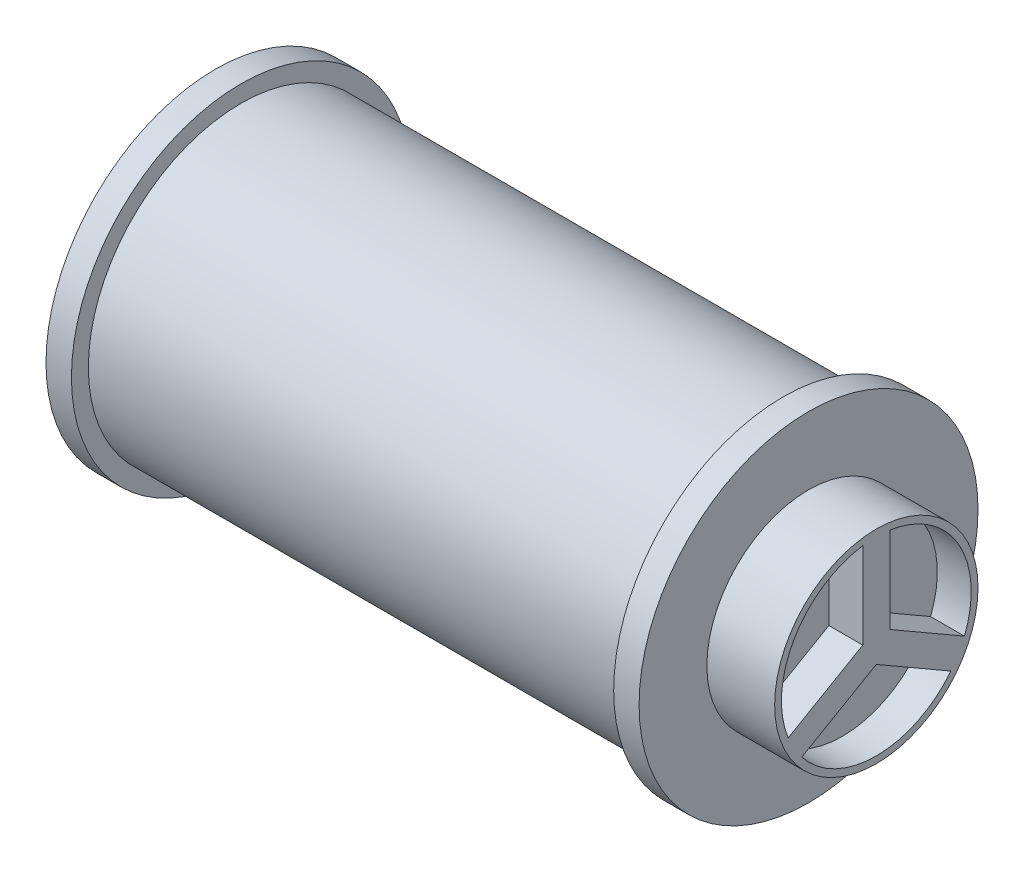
ISO-10303-21;
HEADER;
FILE_DESCRIPTION(('STEP AP214'),'2;1');
FILE_NAME('part.step','',(''),(''),'','','');
FILE_SCHEMA(('AUTOMOTIVE_DESIGN { 1 0 10303 214 1 1 1 1 }'));
ENDSEC;
DATA;
#1=APPLICATION_CONTEXT('core data for automotive mechanical design processes');
#2=APPLICATION_PROTOCOL_DEFINITION('international standard','automotive_design',2000,#1);
#3=PRODUCT_CONTEXT('',#1,'mechanical');
#4=PRODUCT('Part','Part','',(#3));
#5=PRODUCT_RELATED_PRODUCT_CATEGORY('part','',(#4));
#6=PRODUCT_DEFINITION_FORMATION('','',#4);
#7=PRODUCT_DEFINITION_CONTEXT('part definition',#1,'design');
#8=PRODUCT_DEFINITION('design','',#6,#7);
#9=PRODUCT_DEFINITION_SHAPE('','',#8);
#10=(LENGTH_UNIT() NAMED_UNIT(*) SI_UNIT(.MILLI.,.METRE.));
#11=(NAMED_UNIT(*) PLANE_ANGLE_UNIT() SI_UNIT($,.RADIAN.));
#12=(NAMED_UNIT(*) SI_UNIT($,.STERADIAN.) SOLID_ANGLE_UNIT());
#13=UNCERTAINTY_MEASURE_WITH_UNIT(LENGTH_MEASURE(1.E-05),#10,'distance_accuracy_value','');
#14=(GEOMETRIC_REPRESENTATION_CONTEXT(3) GLOBAL_UNCERTAINTY_ASSIGNED_CONTEXT((#13)) GLOBAL_UNIT_ASSIGNED_CONTEXT((#10,
#11,#12)) REPRESENTATION_CONTEXT('',''));
#15=CARTESIAN_POINT('',(0.,0.,0.));
#16=DIRECTION('',(0.,0.,1.));
#17=DIRECTION('',(1.,0.,0.));
#18=AXIS2_PLACEMENT_3D('',#15,#16,#17);
#19=CARTESIAN_POINT('',(1.,0.,0.));
#20=DIRECTION('',(-1.,0.,0.));
#21=DIRECTION('',(0.,0.,1.));
#22=AXIS2_PLACEMENT_3D('',#19,#20,#21);
#23=PLANE('',#22);
#24=CARTESIAN_POINT('',(1.,0.,0.));
#25=DIRECTION('',(1.,0.,0.));
#26=DIRECTION('',(0.,0.,-1.));
#27=AXIS2_PLACEMENT_3D('',#24,#25,#26);
#28=CIRCLE('',#27,5.);
#29=CARTESIAN_POINT('',(1.,0.,-5.));
#30=VERTEX_POINT('',#29);
#31=EDGE_CURVE('E11',#30,#30,#28,.T.);
#32=ORIENTED_EDGE('',*,*,#31,.F.);
#33=EDGE_LOOP('',(#32));
#34=FACE_BOUND('',#33,.T.);
#35=ADVANCED_FACE('F35',(#34),#23,.T.);
#36=CARTESIAN_POINT('',(22.5133115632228,0.,0.));
#37=DIRECTION('',(1.,0.,0.));
#38=DIRECTION('',(0.,0.,-1.));
#39=AXIS2_PLACEMENT_3D('',#36,#37,#38);
#40=CYLINDRICAL_SURFACE('',#39,5.);
#41=ORIENTED_EDGE('',*,*,#31,.T.);
#42=EDGE_LOOP('',(#41));
#43=FACE_BOUND('',#42,.T.);
#44=CARTESIAN_POINT('',(1.75,0.,0.));
#45=DIRECTION('',(1.,0.,0.));
#46=DIRECTION('',(0.,0.,-1.));
#47=AXIS2_PLACEMENT_3D('',#44,#45,#46);
#48=CIRCLE('',#47,5.);
#49=CARTESIAN_POINT('',(1.75,0.,-5.));
#50=VERTEX_POINT('',#49);
#51=EDGE_CURVE('E42',#50,#50,#48,.T.);
#52=ORIENTED_EDGE('',*,*,#51,.F.);
#53=EDGE_LOOP('',(#52));
#54=FACE_BOUND('',#53,.T.);
#55=ADVANCED_FACE('F205',(#43,#54),#40,.T.);
#56=CARTESIAN_POINT('',(1.75,5.,0.));
#57=DIRECTION('',(1.,0.,0.));
#58=DIRECTION('',(0.,0.,-1.));
#59=AXIS2_PLACEMENT_3D('',#56,#57,#58);
#60=PLANE('',#59);
#61=ORIENTED_EDGE('',*,*,#51,.T.);
#62=EDGE_LOOP('',(#61));
#63=FACE_BOUND('',#62,.T.);
#64=CARTESIAN_POINT('',(1.75,0.,0.));
#65=DIRECTION('',(1.,0.,0.));
#66=DIRECTION('',(0.,0.,-1.));
#67=AXIS2_PLACEMENT_3D('',#64,#65,#66);
#68=CIRCLE('',#67,4.5);
#69=CARTESIAN_POINT('',(1.75,0.,-4.5));
#70=VERTEX_POINT('',#69);
#71=EDGE_CURVE('E197',#70,#70,#68,.T.);
#72=ORIENTED_EDGE('',*,*,#71,.F.);
#73=EDGE_LOOP('',(#72));
#74=FACE_BOUND('',#73,.T.);
#75=ADVANCED_FACE('F202',(#63,#74),#60,.T.);
#76=CARTESIAN_POINT('',(22.5133115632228,0.,0.));
#77=DIRECTION('',(1.,0.,0.));
#78=DIRECTION('',(0.,0.,-1.));
#79=AXIS2_PLACEMENT_3D('',#76,#77,#78);
#80=CYLINDRICAL_SURFACE('',#79,4.5);
#81=ORIENTED_EDGE('',*,*,#71,.T.);
#82=EDGE_LOOP('',(#81));
#83=FACE_BOUND('',#82,.T.);
#84=CARTESIAN_POINT('',(17.75,0.,0.));
#85=DIRECTION('',(1.,0.,0.));
#86=DIRECTION('',(0.,0.,-1.));
#87=AXIS2_PLACEMENT_3D('',#84,#85,#86);
#88=CIRCLE('',#87,4.5);
#89=CARTESIAN_POINT('',(17.75,0.,-4.5));
#90=VERTEX_POINT('',#89);
#91=EDGE_CURVE('E194',#90,#90,#88,.T.);
#92=ORIENTED_EDGE('',*,*,#91,.F.);
#93=EDGE_LOOP('',(#92));
#94=FACE_BOUND('',#93,.T.);
#95=ADVANCED_FACE('F212',(#83,#94),#80,.T.);
#96=CARTESIAN_POINT('',(17.75,4.5,0.));
#97=DIRECTION('',(-1.,0.,0.));
#98=DIRECTION('',(0.,0.,1.));
#99=AXIS2_PLACEMENT_3D('',#96,#97,#98);
#100=PLANE('',#99);
#101=ORIENTED_EDGE('',*,*,#91,.T.);
#102=EDGE_LOOP('',(#101));
#103=FACE_BOUND('',#102,.T.);
#104=CARTESIAN_POINT('',(17.75,0.,0.));
#105=DIRECTION('',(1.,0.,0.));
#106=DIRECTION('',(0.,0.,-1.));
#107=AXIS2_PLACEMENT_3D('',#104,#105,#106);
#108=CIRCLE('',#107,5.);
#109=CARTESIAN_POINT('',(17.75,0.,-5.));
#110=VERTEX_POINT('',#109);
#111=EDGE_CURVE('E191',#110,#110,#108,.T.);
#112=ORIENTED_EDGE('',*,*,#111,.F.);
#113=EDGE_LOOP('',(#112));
#114=FACE_BOUND('',#113,.T.);
#115=ADVANCED_FACE('F218',(#103,#114),#100,.T.);
#116=CARTESIAN_POINT('',(22.5133115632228,0.,0.));
#117=DIRECTION('',(1.,0.,0.));
#118=DIRECTION('',(0.,0.,-1.));
#119=AXIS2_PLACEMENT_3D('',#116,#117,#118);
#120=CYLINDRICAL_SURFACE('',#119,5.);
#121=ORIENTED_EDGE('',*,*,#111,.T.);
#122=EDGE_LOOP('',(#121));
#123=FACE_BOUND('',#122,.T.);
#124=CARTESIAN_POINT('',(18.5,0.,0.));
#125=DIRECTION('',(1.,0.,0.));
#126=DIRECTION('',(0.,0.,-1.));
#127=AXIS2_PLACEMENT_3D('',#124,#125,#126);
#128=CIRCLE('',#127,5.);
#129=CARTESIAN_POINT('',(18.5,0.,-5.));
#130=VERTEX_POINT('',#129);
#131=EDGE_CURVE('E188',#130,#130,#128,.T.);
#132=ORIENTED_EDGE('',*,*,#131,.F.);
#133=EDGE_LOOP('',(#132));
#134=FACE_BOUND('',#133,.T.);
#135=ADVANCED_FACE('F222',(#123,#134),#120,.T.);
#136=CARTESIAN_POINT('',(18.5,5.,0.));
#137=DIRECTION('',(1.,0.,0.));
#138=DIRECTION('',(0.,0.,-1.));
#139=AXIS2_PLACEMENT_3D('',#136,#137,#138);
#140=PLANE('',#139);
#141=ORIENTED_EDGE('',*,*,#131,.T.);
#142=EDGE_LOOP('',(#141));
#143=FACE_BOUND('',#142,.T.);
#144=CARTESIAN_POINT('',(18.5,0.,0.));
#145=DIRECTION('',(1.,0.,0.));
#146=DIRECTION('',(0.,0.,-1.));
#147=AXIS2_PLACEMENT_3D('',#144,#145,#146);
#148=CIRCLE('',#147,3.);
#149=CARTESIAN_POINT('',(18.5,0.,-3.));
#150=VERTEX_POINT('',#149);
#151=EDGE_CURVE('E185',#150,#150,#148,.T.);
#152=ORIENTED_EDGE('',*,*,#151,.F.);
#153=EDGE_LOOP('',(#152));
#154=FACE_BOUND('',#153,.T.);
#155=ADVANCED_FACE('F226',(#143,#154),#140,.T.);
#156=CARTESIAN_POINT('',(22.5133115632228,0.,0.));
#157=DIRECTION('',(1.,0.,0.));
#158=DIRECTION('',(0.,0.,-1.));
#159=AXIS2_PLACEMENT_3D('',#156,#157,#158);
#160=CYLINDRICAL_SURFACE('',#159,3.);
#161=ORIENTED_EDGE('',*,*,#151,.T.);
#162=EDGE_LOOP('',(#161));
#163=FACE_BOUND('',#162,.T.);
#164=CARTESIAN_POINT('',(20.5,0.,0.));
#165=DIRECTION('',(1.,0.,0.));
#166=DIRECTION('',(0.,0.,-1.));
#167=AXIS2_PLACEMENT_3D('',#164,#165,#166);
#168=CIRCLE('',#167,3.);
#169=CARTESIAN_POINT('',(20.5,0.,-3.));
#170=VERTEX_POINT('',#169);
#171=EDGE_CURVE('E178',#170,#170,#168,.T.);
#172=ORIENTED_EDGE('',*,*,#171,.F.);
#173=EDGE_LOOP('',(#172));
#174=FACE_BOUND('',#173,.T.);
#175=ADVANCED_FACE('F230',(#163,#174),#160,.T.);
#176=CARTESIAN_POINT('',(20.5,3.,0.));
#177=DIRECTION('',(1.,0.,0.));
#178=DIRECTION('',(0.,0.,-1.));
#179=AXIS2_PLACEMENT_3D('',#176,#177,#178);
#180=PLANE('',#179);
#181=CARTESIAN_POINT('',(20.5,0.,0.));
#182=DIRECTION('',(1.,0.,0.));
#183=DIRECTION('',(0.,-0.866025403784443,0.499999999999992));
#184=AXIS2_PLACEMENT_3D('',#181,#182,#183);
#185=CIRCLE('',#184,2.8);
#186=CARTESIAN_POINT('',(20.5,-1.0392304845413,-2.60000000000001));
#187=VERTEX_POINT('',#186);
#188=CARTESIAN_POINT('',(20.5,2.77128129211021,-0.39999999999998));
#189=VERTEX_POINT('',#188);
#190=EDGE_CURVE('E49',#187,#189,#185,.T.);
#191=ORIENTED_EDGE('',*,*,#190,.F.);
#192=DIRECTION('',(0.,-0.499999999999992,-0.866025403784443));
#193=VECTOR('',#192,1.);
#194=CARTESIAN_POINT('',(20.5,-1.0392304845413,-2.60000000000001));
#195=LINE('',#194,#193);
#196=CARTESIAN_POINT('',(20.5,0.230940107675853,-0.399999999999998));
#197=VERTEX_POINT('',#196);
#198=EDGE_CURVE('E109',#197,#187,#195,.T.);
#199=ORIENTED_EDGE('',*,*,#198,.F.);
#200=DIRECTION('',(0.,-1.,0.));
#201=VECTOR('',#200,1.);
#202=CARTESIAN_POINT('',(20.5,0.230940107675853,-0.399999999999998));
#203=LINE('',#202,#201);
#204=EDGE_CURVE('E119',#189,#197,#203,.T.);
#205=ORIENTED_EDGE('',*,*,#204,.F.);
#206=EDGE_LOOP('',(#191,#199,#205));
#207=FACE_BOUND('',#206,.T.);
#208=CARTESIAN_POINT('',(20.5,0.,0.));
#209=DIRECTION('',(1.,0.,0.));
#210=DIRECTION('',(0.,0.866025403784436,0.500000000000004));
#211=AXIS2_PLACEMENT_3D('',#208,#209,#210);
#212=CIRCLE('',#211,2.8);
#213=CARTESIAN_POINT('',(20.5,-1.73205080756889,2.19999999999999));
#214=VERTEX_POINT('',#213);
#215=CARTESIAN_POINT('',(20.5,-1.73205080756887,-2.2));
#216=VERTEX_POINT('',#215);
#217=EDGE_CURVE('E57',#214,#216,#212,.T.);
#218=ORIENTED_EDGE('',*,*,#217,.F.);
#219=DIRECTION('',(0.,-0.500000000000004,0.866025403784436));
#220=VECTOR('',#219,1.);
#221=CARTESIAN_POINT('',(20.5,-1.73205080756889,2.19999999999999));
#222=LINE('',#221,#220);
#223=CARTESIAN_POINT('',(20.5,-0.461880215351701,0.));
#224=VERTEX_POINT('',#223);
#225=EDGE_CURVE('E140',#224,#214,#222,.T.);
#226=ORIENTED_EDGE('',*,*,#225,.F.);
#227=DIRECTION('',(0.,0.499999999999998,0.86602540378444));
#228=VECTOR('',#227,1.);
#229=CARTESIAN_POINT('',(20.5,-0.461880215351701,0.));
#230=LINE('',#229,#228);
#231=EDGE_CURVE('E137',#216,#224,#230,.T.);
#232=ORIENTED_EDGE('',*,*,#231,.F.);
#233=EDGE_LOOP('',(#218,#226,#232));
#234=FACE_BOUND('',#233,.T.);
#235=CARTESIAN_POINT('',(20.5,0.,0.));
#236=DIRECTION('',(1.,0.,0.));
#237=DIRECTION('',(0.,0.,-1.));
#238=AXIS2_PLACEMENT_3D('',#235,#236,#237);
#239=CIRCLE('',#238,2.8);
#240=CARTESIAN_POINT('',(20.5,2.7712812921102,0.4));
#241=VERTEX_POINT('',#240);
#242=CARTESIAN_POINT('',(20.5,-1.03923048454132,2.6));
#243=VERTEX_POINT('',#242);
#244=EDGE_CURVE('E155',#241,#243,#239,.T.);
#245=ORIENTED_EDGE('',*,*,#244,.F.);
#246=DIRECTION('',(0.,1.,0.));
#247=VECTOR('',#246,1.);
#248=CARTESIAN_POINT('',(20.5,2.7712812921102,0.4));
#249=LINE('',#248,#247);
#250=CARTESIAN_POINT('',(20.5,0.230940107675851,0.399999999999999));
#251=VERTEX_POINT('',#250);
#252=EDGE_CURVE('E163',#251,#241,#249,.T.);
#253=ORIENTED_EDGE('',*,*,#252,.F.);
#254=DIRECTION('',(0.,0.499999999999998,-0.86602540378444));
#255=VECTOR('',#254,1.);
#256=CARTESIAN_POINT('',(20.5,0.230940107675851,0.399999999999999));
#257=LINE('',#256,#255);
#258=EDGE_CURVE('E160',#243,#251,#257,.T.);
#259=ORIENTED_EDGE('',*,*,#258,.F.);
#260=EDGE_LOOP('',(#245,#253,#259));
#261=FACE_BOUND('',#260,.T.);
#262=ORIENTED_EDGE('',*,*,#171,.T.);
#263=EDGE_LOOP('',(#262));
#264=FACE_BOUND('',#263,.T.);
#265=ADVANCED_FACE('F123',(#207,#234,#261,#264),#180,.T.);
#266=CARTESIAN_POINT('',(19.5,0.,0.));
#267=DIRECTION('',(1.,0.,0.));
#268=DIRECTION('',(0.,0.,-1.));
#269=AXIS2_PLACEMENT_3D('',#266,#267,#268);
#270=CYLINDRICAL_SURFACE('',#269,2.8);
#271=ORIENTED_EDGE('',*,*,#244,.T.);
#272=DIRECTION('',(1.,0.,0.));
#273=VECTOR('',#272,1.);
#274=CARTESIAN_POINT('',(19.5,-1.03923048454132,2.6));
#275=LINE('',#274,#273);
#276=CARTESIAN_POINT('',(19.5,-1.03923048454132,2.6));
#277=VERTEX_POINT('',#276);
#278=EDGE_CURVE('E175',#277,#243,#275,.T.);
#279=ORIENTED_EDGE('',*,*,#278,.F.);
#280=CARTESIAN_POINT('',(19.5,0.,0.));
#281=DIRECTION('',(1.,0.,0.));
#282=DIRECTION('',(0.,0.,-1.));
#283=AXIS2_PLACEMENT_3D('',#280,#281,#282);
#284=CIRCLE('',#283,2.8);
#285=CARTESIAN_POINT('',(19.5,2.7712812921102,0.4));
#286=VERTEX_POINT('',#285);
#287=EDGE_CURVE('E166',#286,#277,#284,.T.);
#288=ORIENTED_EDGE('',*,*,#287,.F.);
#289=DIRECTION('',(1.,0.,0.));
#290=VECTOR('',#289,1.);
#291=CARTESIAN_POINT('',(19.5,2.7712812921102,0.4));
#292=LINE('',#291,#290);
#293=EDGE_CURVE('E176',#286,#241,#292,.T.);
#294=ORIENTED_EDGE('',*,*,#293,.T.);
#295=EDGE_LOOP('',(#271,#279,#288,#294));
#296=FACE_BOUND('',#295,.T.);
#297=ADVANCED_FACE('F237',(#296),#270,.F.);
#298=CARTESIAN_POINT('',(19.5,2.7712812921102,0.4));
#299=DIRECTION('',(0.,0.,-1.));
#300=DIRECTION('',(0.,1.,0.));
#301=AXIS2_PLACEMENT_3D('',#298,#299,#300);
#302=PLANE('',#301);
#303=ORIENTED_EDGE('',*,*,#252,.T.);
#304=ORIENTED_EDGE('',*,*,#293,.F.);
#305=DIRECTION('',(0.,1.,0.));
#306=VECTOR('',#305,1.);
#307=CARTESIAN_POINT('',(19.5,2.7712812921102,0.4));
#308=LINE('',#307,#306);
#309=CARTESIAN_POINT('',(19.5,0.230940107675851,0.399999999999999));
#310=VERTEX_POINT('',#309);
#311=EDGE_CURVE('E172',#310,#286,#308,.T.);
#312=ORIENTED_EDGE('',*,*,#311,.F.);
#313=DIRECTION('',(1.,0.,0.));
#314=VECTOR('',#313,1.);
#315=CARTESIAN_POINT('',(19.5,0.230940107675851,0.399999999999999));
#316=LINE('',#315,#314);
#317=EDGE_CURVE('E179',#310,#251,#316,.T.);
#318=ORIENTED_EDGE('',*,*,#317,.T.);
#319=EDGE_LOOP('',(#303,#304,#312,#318));
#320=FACE_BOUND('',#319,.T.);
#321=ADVANCED_FACE('F240',(#320),#302,.F.);
#322=CARTESIAN_POINT('',(19.5,0.230940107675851,0.399999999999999));
#323=DIRECTION('',(0.,-0.86602540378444,-0.499999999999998));
#324=DIRECTION('',(0.,0.499999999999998,-0.86602540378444));
#325=AXIS2_PLACEMENT_3D('',#322,#323,#324);
#326=PLANE('',#325);
#327=ORIENTED_EDGE('',*,*,#258,.T.);
#328=ORIENTED_EDGE('',*,*,#317,.F.);
#329=DIRECTION('',(0.,0.499999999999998,-0.86602540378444));
#330=VECTOR('',#329,1.);
#331=CARTESIAN_POINT('',(19.5,0.230940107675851,0.399999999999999));
#332=LINE('',#331,#330);
#333=EDGE_CURVE('E169',#277,#310,#332,.T.);
#334=ORIENTED_EDGE('',*,*,#333,.F.);
#335=ORIENTED_EDGE('',*,*,#278,.T.);
#336=EDGE_LOOP('',(#327,#328,#334,#335));
#337=FACE_BOUND('',#336,.T.);
#338=ADVANCED_FACE('F242',(#337),#326,.F.);
#339=CARTESIAN_POINT('',(19.5,0.,0.));
#340=DIRECTION('',(1.,0.,0.));
#341=DIRECTION('',(0.,0.,-1.));
#342=AXIS2_PLACEMENT_3D('',#339,#340,#341);
#343=PLANE('',#342);
#344=ORIENTED_EDGE('',*,*,#287,.T.);
#345=ORIENTED_EDGE('',*,*,#333,.T.);
#346=ORIENTED_EDGE('',*,*,#311,.T.);
#347=EDGE_LOOP('',(#344,#345,#346));
#348=FACE_BOUND('',#347,.T.);
#349=ADVANCED_FACE('F245',(#348),#343,.T.);
#350=CARTESIAN_POINT('',(19.5,0.,0.));
#351=DIRECTION('',(1.,0.,0.));
#352=DIRECTION('',(0.,0.,-1.));
#353=AXIS2_PLACEMENT_3D('',#350,#351,#352);
#354=CYLINDRICAL_SURFACE('',#353,2.8);
#355=ORIENTED_EDGE('',*,*,#217,.T.);
#356=DIRECTION('',(1.,0.,0.));
#357=VECTOR('',#356,1.);
#358=CARTESIAN_POINT('',(19.5,-1.73205080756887,-2.2));
#359=LINE('',#358,#357);
#360=CARTESIAN_POINT('',(19.5,-1.73205080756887,-2.2));
#361=VERTEX_POINT('',#360);
#362=EDGE_CURVE('E152',#361,#216,#359,.T.);
#363=ORIENTED_EDGE('',*,*,#362,.F.);
#364=CARTESIAN_POINT('',(19.5,0.,0.));
#365=DIRECTION('',(1.,0.,0.));
#366=DIRECTION('',(0.,0.866025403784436,0.500000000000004));
#367=AXIS2_PLACEMENT_3D('',#364,#365,#366);
#368=CIRCLE('',#367,2.8);
#369=CARTESIAN_POINT('',(19.5,-1.73205080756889,2.19999999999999));
#370=VERTEX_POINT('',#369);
#371=EDGE_CURVE('E143',#370,#361,#368,.T.);
#372=ORIENTED_EDGE('',*,*,#371,.F.);
#373=DIRECTION('',(1.,0.,0.));
#374=VECTOR('',#373,1.);
#375=CARTESIAN_POINT('',(19.5,-1.73205080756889,2.19999999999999));
#376=LINE('',#375,#374);
#377=EDGE_CURVE('E153',#370,#214,#376,.T.);
#378=ORIENTED_EDGE('',*,*,#377,.T.);
#379=EDGE_LOOP('',(#355,#363,#372,#378));
#380=FACE_BOUND('',#379,.T.);
#381=ADVANCED_FACE('F252',(#380),#354,.F.);
#382=CARTESIAN_POINT('',(19.5,-1.73205080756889,2.19999999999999));
#383=DIRECTION('',(0.,0.866025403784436,0.500000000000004));
#384=DIRECTION('',(0.,-0.500000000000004,0.866025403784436));
#385=AXIS2_PLACEMENT_3D('',#382,#383,#384);
#386=PLANE('',#385);
#387=ORIENTED_EDGE('',*,*,#225,.T.);
#388=ORIENTED_EDGE('',*,*,#377,.F.);
#389=DIRECTION('',(0.,-0.500000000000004,0.866025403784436));
#390=VECTOR('',#389,1.);
#391=CARTESIAN_POINT('',(19.5,-1.73205080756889,2.19999999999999));
#392=LINE('',#391,#390);
#393=CARTESIAN_POINT('',(19.5,-0.461880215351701,0.));
#394=VERTEX_POINT('',#393);
#395=EDGE_CURVE('E149',#394,#370,#392,.T.);
#396=ORIENTED_EDGE('',*,*,#395,.F.);
#397=DIRECTION('',(1.,0.,0.));
#398=VECTOR('',#397,1.);
#399=CARTESIAN_POINT('',(19.5,-0.461880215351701,0.));
#400=LINE('',#399,#398);
#401=EDGE_CURVE('E156',#394,#224,#400,.T.);
#402=ORIENTED_EDGE('',*,*,#401,.T.);
#403=EDGE_LOOP('',(#387,#388,#396,#402));
#404=FACE_BOUND('',#403,.T.);
#405=ADVANCED_FACE('F256',(#404),#386,.F.);
#406=CARTESIAN_POINT('',(19.5,-0.461880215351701,0.));
#407=DIRECTION('',(0.,0.86602540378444,-0.499999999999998));
#408=DIRECTION('',(0.,0.499999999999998,0.86602540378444));
#409=AXIS2_PLACEMENT_3D('',#406,#407,#408);
#410=PLANE('',#409);
#411=ORIENTED_EDGE('',*,*,#231,.T.);
#412=ORIENTED_EDGE('',*,*,#401,.F.);
#413=DIRECTION('',(0.,0.499999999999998,0.86602540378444));
#414=VECTOR('',#413,1.);
#415=CARTESIAN_POINT('',(19.5,-0.461880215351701,0.));
#416=LINE('',#415,#414);
#417=EDGE_CURVE('E146',#361,#394,#416,.T.);
#418=ORIENTED_EDGE('',*,*,#417,.F.);
#419=ORIENTED_EDGE('',*,*,#362,.T.);
#420=EDGE_LOOP('',(#411,#412,#418,#419));
#421=FACE_BOUND('',#420,.T.);
#422=ADVANCED_FACE('F257',(#421),#410,.F.);
#423=CARTESIAN_POINT('',(19.5,0.,0.));
#424=DIRECTION('',(1.,0.,0.));
#425=DIRECTION('',(0.,0.866025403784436,0.500000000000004));
#426=AXIS2_PLACEMENT_3D('',#423,#424,#425);
#427=PLANE('',#426);
#428=ORIENTED_EDGE('',*,*,#371,.T.);
#429=ORIENTED_EDGE('',*,*,#417,.T.);
#430=ORIENTED_EDGE('',*,*,#395,.T.);
#431=EDGE_LOOP('',(#428,#429,#430));
#432=FACE_BOUND('',#431,.T.);
#433=ADVANCED_FACE('F260',(#432),#427,.T.);
#434=CARTESIAN_POINT('',(19.5,0.,0.));
#435=DIRECTION('',(1.,0.,0.));
#436=DIRECTION('',(0.,0.,-1.));
#437=AXIS2_PLACEMENT_3D('',#434,#435,#436);
#438=CYLINDRICAL_SURFACE('',#437,2.8);
#439=ORIENTED_EDGE('',*,*,#190,.T.);
#440=DIRECTION('',(1.,0.,0.));
#441=VECTOR('',#440,1.);
#442=CARTESIAN_POINT('',(19.5,2.77128129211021,-0.39999999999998));
#443=LINE('',#442,#441);
#444=CARTESIAN_POINT('',(19.5,2.77128129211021,-0.39999999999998));
#445=VERTEX_POINT('',#444);
#446=EDGE_CURVE('E116',#445,#189,#443,.T.);
#447=ORIENTED_EDGE('',*,*,#446,.F.);
#448=CARTESIAN_POINT('',(19.5,0.,0.));
#449=DIRECTION('',(1.,0.,0.));
#450=DIRECTION('',(0.,-0.866025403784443,0.499999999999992));
#451=AXIS2_PLACEMENT_3D('',#448,#449,#450);
#452=CIRCLE('',#451,2.8);
#453=CARTESIAN_POINT('',(19.5,-1.0392304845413,-2.60000000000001));
#454=VERTEX_POINT('',#453);
#455=EDGE_CURVE('E125',#454,#445,#452,.T.);
#456=ORIENTED_EDGE('',*,*,#455,.F.);
#457=DIRECTION('',(1.,0.,0.));
#458=VECTOR('',#457,1.);
#459=CARTESIAN_POINT('',(19.5,-1.0392304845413,-2.60000000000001));
#460=LINE('',#459,#458);
#461=EDGE_CURVE('E115',#454,#187,#460,.T.);
#462=ORIENTED_EDGE('',*,*,#461,.T.);
#463=EDGE_LOOP('',(#439,#447,#456,#462));
#464=FACE_BOUND('',#463,.T.);
#465=ADVANCED_FACE('F267',(#464),#438,.F.);
#466=CARTESIAN_POINT('',(19.5,-1.0392304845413,-2.60000000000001));
#467=DIRECTION('',(0.,-0.866025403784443,0.499999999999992));
#468=DIRECTION('',(0.,-0.499999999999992,-0.866025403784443));
#469=AXIS2_PLACEMENT_3D('',#466,#467,#468);
#470=PLANE('',#469);
#471=ORIENTED_EDGE('',*,*,#198,.T.);
#472=ORIENTED_EDGE('',*,*,#461,.F.);
#473=DIRECTION('',(0.,-0.499999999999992,-0.866025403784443));
#474=VECTOR('',#473,1.);
#475=CARTESIAN_POINT('',(19.5,-1.0392304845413,-2.60000000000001));
#476=LINE('',#475,#474);
#477=CARTESIAN_POINT('',(19.5,0.230940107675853,-0.399999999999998));
#478=VERTEX_POINT('',#477);
#479=EDGE_CURVE('E111',#478,#454,#476,.T.);
#480=ORIENTED_EDGE('',*,*,#479,.F.);
#481=DIRECTION('',(1.,0.,0.));
#482=VECTOR('',#481,1.);
#483=CARTESIAN_POINT('',(19.5,0.230940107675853,-0.399999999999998));
#484=LINE('',#483,#482);
#485=EDGE_CURVE('E105',#478,#197,#484,.T.);
#486=ORIENTED_EDGE('',*,*,#485,.T.);
#487=EDGE_LOOP('',(#471,#472,#480,#486));
#488=FACE_BOUND('',#487,.T.);
#489=ADVANCED_FACE('F107',(#488),#470,.F.);
#490=CARTESIAN_POINT('',(19.5,0.230940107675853,-0.399999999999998));
#491=DIRECTION('',(0.,0.,1.));
#492=DIRECTION('',(0.,-1.,0.));
#493=AXIS2_PLACEMENT_3D('',#490,#491,#492);
#494=PLANE('',#493);
#495=ORIENTED_EDGE('',*,*,#204,.T.);
#496=ORIENTED_EDGE('',*,*,#485,.F.);
#497=DIRECTION('',(0.,-1.,0.));
#498=VECTOR('',#497,1.);
#499=CARTESIAN_POINT('',(19.5,0.230940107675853,-0.399999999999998));
#500=LINE('',#499,#498);
#501=EDGE_CURVE('E128',#445,#478,#500,.T.);
#502=ORIENTED_EDGE('',*,*,#501,.F.);
#503=ORIENTED_EDGE('',*,*,#446,.T.);
#504=EDGE_LOOP('',(#495,#496,#502,#503));
#505=FACE_BOUND('',#504,.T.);
#506=ADVANCED_FACE('F120',(#505),#494,.F.);
#507=CARTESIAN_POINT('',(19.5,0.,0.));
#508=DIRECTION('',(1.,0.,0.));
#509=DIRECTION('',(0.,-0.866025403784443,0.499999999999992));
#510=AXIS2_PLACEMENT_3D('',#507,#508,#509);
#511=PLANE('',#510);
#512=ORIENTED_EDGE('',*,*,#455,.T.);
#513=ORIENTED_EDGE('',*,*,#501,.T.);
#514=ORIENTED_EDGE('',*,*,#479,.T.);
#515=EDGE_LOOP('',(#512,#513,#514));
#516=FACE_BOUND('',#515,.T.);
#517=ADVANCED_FACE('F273',(#516),#511,.T.);
#518=CLOSED_SHELL('',(#35,#55,#75,#95,#115,#135,#155,#175,#265,#297,#321,#338,#349,#381,#405,
#422,#433,#465,#489,#506,#517));
#519=MANIFOLD_SOLID_BREP('B2',#518);
#520=ADVANCED_BREP_SHAPE_REPRESENTATION('',(#18,#519),#14);
#521=SHAPE_DEFINITION_REPRESENTATION(#9,#520);
ENDSEC;
END-ISO-10303-21;
